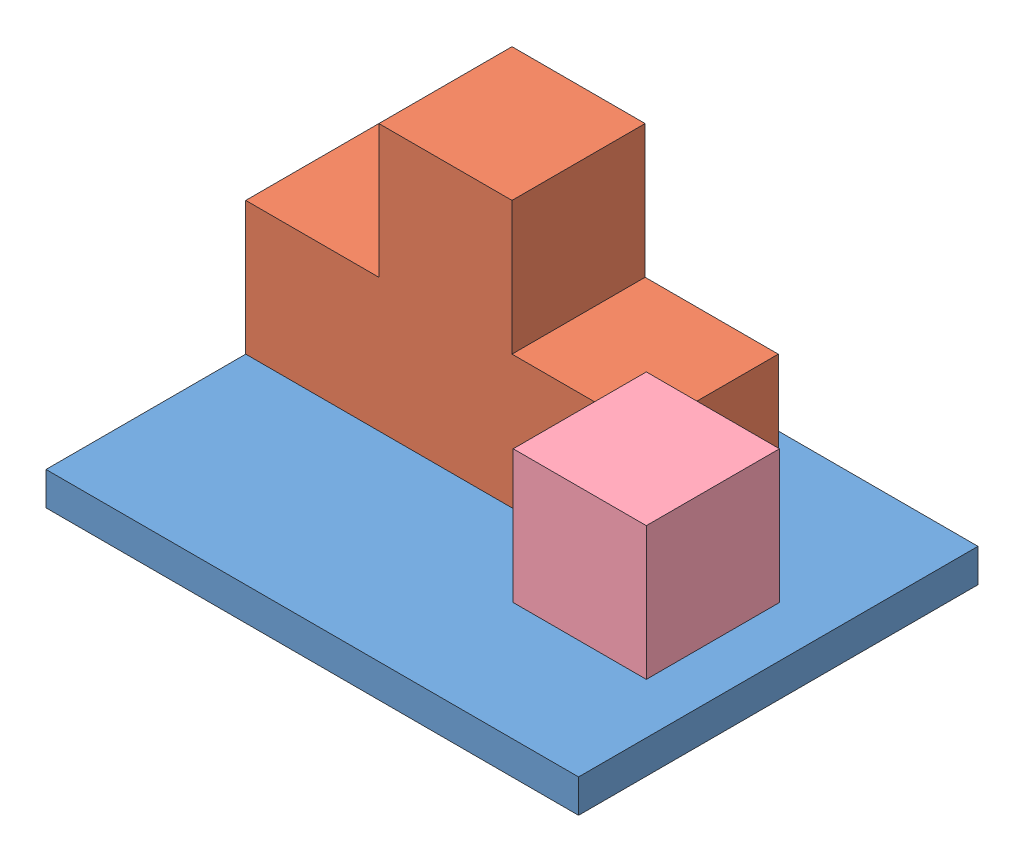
SolidWorks assembly Interference Detection.SLDASM, configuration Default (file format 6000). Lengths in mm.
Overall size (203.2 120.86 152.4).
5 component instances, 4 part files, 8 mates.
Components (placement in the parent):
- Base Plate-1: Base Plate.SLDPRT [Default] at origin size (203.2 12.7 152.4)
- T Block-1: T Block.SLDPRT [Default] at (76.2 12.7 50.8) size (152.4 101.6 50.8)
- pan cross head_ai-3: pan cross head_ai.sldprt [PreviewCfg] at (23.7272 -6.6294 51.6362) x (0 1 0) z (0.222746 0 0.974876) size (44.66 18.8 18.8)
- pan cross head_ai-4: pan cross head_ai.sldprt [PreviewCfg] at (127.1699 -6.6294 51.8919) x (0 1 0) z (0.050528 0 0.998723) size (44.66 18.8 18.8)
- Block-1: Block.SLDPRT [Default] at (158.4989 12.7 81.848) size (50.8 50.8 50.8)
Mates (geometry in assembly coordinates):
- Coincident41: coincident anti-aligned: plane of Base Plate-1 through (0 12.7 152.4) normal (0 1 0); plane of T Block-1 through (76.4923 12.7 76.2) normal (0 -1 0)
- Distance5: distance = 76.2 mm aligned: plane of T Block-1 through (76.4923 -113.1572 76.2) normal (0 0 1); plane of Base Plate-1 through (0 12.7 152.4) normal (0 0 1)
- Coincident34: coincident aligned: plane of Base Plate-1 through (0 0 152.4) normal (-1 0 0); plane of T Block-1 through (0 -113.4112 76.2) normal (-1 0 0)
- Coincident37: coincident: plane of Base Plate-1 through (0 0 152.4) normal (0 -1 0); plane of ? through (134.0801 0 101.0719) normal (0 1 0)
- Coincident38: coincident anti-aligned: plane of Base Plate-1 through (0 0 152.4) normal (0 -1 0); plane of pan cross head_ai-3 through (19.0843 0 52.6971) normal (0 1 0)
- Coincident39: coincident anti-aligned: plane of Base Plate-1 through (0 0 152.4) normal (0 -1 0); plane of pan cross head_ai-4 through (122.4135 0 52.1325) normal (0 1 0)
- Coincident40: coincident anti-aligned: plane of Base Plate-1 through (0 12.7 152.4) normal (0 1 0); plane of Block-1 through (133.0989 12.7 107.248) normal (0 -1 0)
- Parallel1: parallel aligned: plane of Base Plate-1 through (0 12.7 152.4) normal (0 0 1); plane of Block-1 through (133.0989 63.5 107.248) normal (0 0 1)
